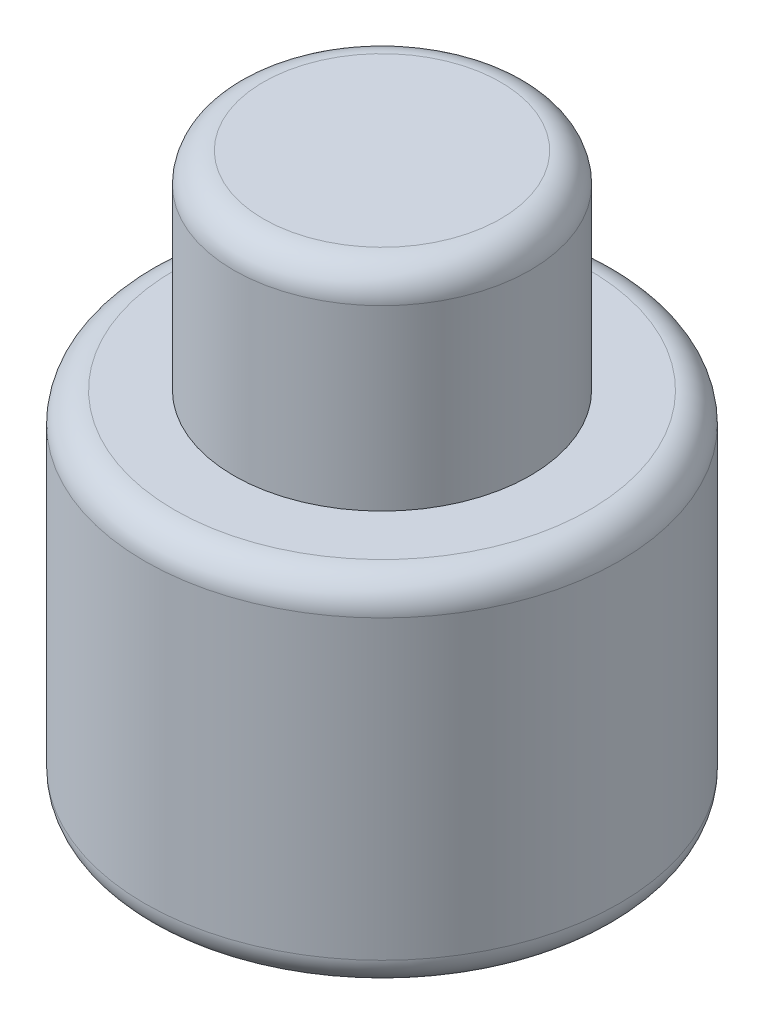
ISO-10303-21;
HEADER;
FILE_DESCRIPTION(('STEP AP214'),'2;1');
FILE_NAME('part.step','',(''),(''),'','','');
FILE_SCHEMA(('AUTOMOTIVE_DESIGN { 1 0 10303 214 1 1 1 1 }'));
ENDSEC;
DATA;
#1=APPLICATION_CONTEXT('core data for automotive mechanical design processes');
#2=APPLICATION_PROTOCOL_DEFINITION('international standard','automotive_design',2000,#1);
#3=PRODUCT_CONTEXT('',#1,'mechanical');
#4=PRODUCT('Part','Part','',(#3));
#5=PRODUCT_RELATED_PRODUCT_CATEGORY('part','',(#4));
#6=PRODUCT_DEFINITION_FORMATION('','',#4);
#7=PRODUCT_DEFINITION_CONTEXT('part definition',#1,'design');
#8=PRODUCT_DEFINITION('design','',#6,#7);
#9=PRODUCT_DEFINITION_SHAPE('','',#8);
#10=(LENGTH_UNIT() NAMED_UNIT(*) SI_UNIT(.MILLI.,.METRE.));
#11=(NAMED_UNIT(*) PLANE_ANGLE_UNIT() SI_UNIT($,.RADIAN.));
#12=(NAMED_UNIT(*) SI_UNIT($,.STERADIAN.) SOLID_ANGLE_UNIT());
#13=UNCERTAINTY_MEASURE_WITH_UNIT(LENGTH_MEASURE(1.E-05),#10,'distance_accuracy_value','');
#14=(GEOMETRIC_REPRESENTATION_CONTEXT(3) GLOBAL_UNCERTAINTY_ASSIGNED_CONTEXT((#13)) GLOBAL_UNIT_ASSIGNED_CONTEXT((#10,
#11,#12)) REPRESENTATION_CONTEXT('',''));
#15=CARTESIAN_POINT('',(0.,0.,0.));
#16=DIRECTION('',(0.,0.,1.));
#17=DIRECTION('',(1.,0.,0.));
#18=AXIS2_PLACEMENT_3D('',#15,#16,#17);
#19=CARTESIAN_POINT('',(4.,0.,0.));
#20=DIRECTION('',(0.,-1.,0.));
#21=DIRECTION('',(0.,0.,-1.));
#22=AXIS2_PLACEMENT_3D('',#19,#20,#21);
#23=PLANE('',#22);
#24=CARTESIAN_POINT('',(0.,0.,0.));
#25=DIRECTION('',(0.,-1.,0.));
#26=DIRECTION('',(0.,0.,-1.));
#27=AXIS2_PLACEMENT_3D('',#24,#25,#26);
#28=CIRCLE('',#27,3.5);
#29=CARTESIAN_POINT('',(0.,0.,-3.5));
#30=VERTEX_POINT('',#29);
#31=EDGE_CURVE('E46',#30,#30,#28,.T.);
#32=ORIENTED_EDGE('',*,*,#31,.T.);
#33=EDGE_LOOP('',(#32));
#34=FACE_BOUND('',#33,.T.);
#35=ADVANCED_FACE('F24',(#34),#23,.T.);
#36=CARTESIAN_POINT('',(0.,9.5,0.));
#37=DIRECTION('',(0.,1.,0.));
#38=DIRECTION('',(0.,0.,1.));
#39=AXIS2_PLACEMENT_3D('',#36,#37,#38);
#40=PLANE('',#39);
#41=CARTESIAN_POINT('',(0.,9.5,0.));
#42=DIRECTION('',(0.,1.,0.));
#43=DIRECTION('',(0.,0.,1.));
#44=AXIS2_PLACEMENT_3D('',#41,#42,#43);
#45=CIRCLE('',#44,2.);
#46=CARTESIAN_POINT('',(0.,9.5,2.));
#47=VERTEX_POINT('',#46);
#48=EDGE_CURVE('E10',#47,#47,#45,.T.);
#49=ORIENTED_EDGE('',*,*,#48,.T.);
#50=EDGE_LOOP('',(#49));
#51=FACE_BOUND('',#50,.T.);
#52=ADVANCED_FACE('F57',(#51),#40,.T.);
#53=CARTESIAN_POINT('',(0.,0.,0.));
#54=DIRECTION('',(0.,-1.,0.));
#55=DIRECTION('',(0.,0.,-1.));
#56=AXIS2_PLACEMENT_3D('',#53,#54,#55);
#57=CYLINDRICAL_SURFACE('',#56,2.5);
#58=CARTESIAN_POINT('',(0.,9.,0.));
#59=DIRECTION('',(0.,1.,0.));
#60=DIRECTION('',(0.,0.,1.));
#61=AXIS2_PLACEMENT_3D('',#58,#59,#60);
#62=CIRCLE('',#61,2.5);
#63=CARTESIAN_POINT('',(0.,9.,2.5));
#64=VERTEX_POINT('',#63);
#65=EDGE_CURVE('E30',#64,#64,#62,.F.);
#66=ORIENTED_EDGE('',*,*,#65,.T.);
#67=EDGE_LOOP('',(#66));
#68=FACE_BOUND('',#67,.T.);
#69=CARTESIAN_POINT('',(0.,6.,0.));
#70=DIRECTION('',(0.,-1.,0.));
#71=DIRECTION('',(0.,0.,-1.));
#72=AXIS2_PLACEMENT_3D('',#69,#70,#71);
#73=CIRCLE('',#72,2.5);
#74=CARTESIAN_POINT('',(0.,6.,-2.5));
#75=VERTEX_POINT('',#74);
#76=EDGE_CURVE('E49',#75,#75,#73,.T.);
#77=ORIENTED_EDGE('',*,*,#76,.F.);
#78=EDGE_LOOP('',(#77));
#79=FACE_BOUND('',#78,.T.);
#80=ADVANCED_FACE('F55',(#68,#79),#57,.T.);
#81=CARTESIAN_POINT('',(2.5,6.,0.));
#82=DIRECTION('',(0.,1.,0.));
#83=DIRECTION('',(0.,0.,1.));
#84=AXIS2_PLACEMENT_3D('',#81,#82,#83);
#85=PLANE('',#84);
#86=CARTESIAN_POINT('',(0.,6.,0.));
#87=DIRECTION('',(0.,1.,0.));
#88=DIRECTION('',(0.,0.,1.));
#89=AXIS2_PLACEMENT_3D('',#86,#87,#88);
#90=CIRCLE('',#89,3.5);
#91=CARTESIAN_POINT('',(0.,6.,3.5));
#92=VERTEX_POINT('',#91);
#93=EDGE_CURVE('E34',#92,#92,#90,.T.);
#94=ORIENTED_EDGE('',*,*,#93,.T.);
#95=EDGE_LOOP('',(#94));
#96=FACE_BOUND('',#95,.T.);
#97=ORIENTED_EDGE('',*,*,#76,.T.);
#98=EDGE_LOOP('',(#97));
#99=FACE_BOUND('',#98,.T.);
#100=ADVANCED_FACE('F53',(#96,#99),#85,.T.);
#101=CARTESIAN_POINT('',(0.,0.,0.));
#102=DIRECTION('',(0.,-1.,0.));
#103=DIRECTION('',(0.,0.,-1.));
#104=AXIS2_PLACEMENT_3D('',#101,#102,#103);
#105=CYLINDRICAL_SURFACE('',#104,4.);
#106=CARTESIAN_POINT('',(0.,0.5,0.));
#107=DIRECTION('',(0.,-1.,0.));
#108=DIRECTION('',(0.,0.,-1.));
#109=AXIS2_PLACEMENT_3D('',#106,#107,#108);
#110=CIRCLE('',#109,4.);
#111=CARTESIAN_POINT('',(0.,0.5,-4.));
#112=VERTEX_POINT('',#111);
#113=EDGE_CURVE('E38',#112,#112,#110,.F.);
#114=ORIENTED_EDGE('',*,*,#113,.T.);
#115=EDGE_LOOP('',(#114));
#116=FACE_BOUND('',#115,.T.);
#117=CARTESIAN_POINT('',(0.,5.5,0.));
#118=DIRECTION('',(0.,1.,0.));
#119=DIRECTION('',(0.,0.,1.));
#120=AXIS2_PLACEMENT_3D('',#117,#118,#119);
#121=CIRCLE('',#120,4.);
#122=CARTESIAN_POINT('',(0.,5.5,4.));
#123=VERTEX_POINT('',#122);
#124=EDGE_CURVE('E43',#123,#123,#121,.F.);
#125=ORIENTED_EDGE('',*,*,#124,.T.);
#126=EDGE_LOOP('',(#125));
#127=FACE_BOUND('',#126,.T.);
#128=ADVANCED_FACE('F63',(#116,#127),#105,.T.);
#129=CARTESIAN_POINT('',(0.,0.5,0.));
#130=DIRECTION('',(0.,-1.,0.));
#131=DIRECTION('',(0.,0.,-1.));
#132=AXIS2_PLACEMENT_3D('',#129,#130,#131);
#133=TOROIDAL_SURFACE('',#132,3.5,0.5);
#134=ORIENTED_EDGE('',*,*,#113,.F.);
#135=EDGE_LOOP('',(#134));
#136=FACE_BOUND('',#135,.T.);
#137=ORIENTED_EDGE('',*,*,#31,.F.);
#138=EDGE_LOOP('',(#137));
#139=FACE_BOUND('',#138,.T.);
#140=ADVANCED_FACE('F72',(#136,#139),#133,.T.);
#141=CARTESIAN_POINT('',(0.,5.5,0.));
#142=DIRECTION('',(0.,1.,0.));
#143=DIRECTION('',(0.,0.,1.));
#144=AXIS2_PLACEMENT_3D('',#141,#142,#143);
#145=TOROIDAL_SURFACE('',#144,3.5,0.5);
#146=ORIENTED_EDGE('',*,*,#93,.F.);
#147=EDGE_LOOP('',(#146));
#148=FACE_BOUND('',#147,.T.);
#149=ORIENTED_EDGE('',*,*,#124,.F.);
#150=EDGE_LOOP('',(#149));
#151=FACE_BOUND('',#150,.T.);
#152=ADVANCED_FACE('F74',(#148,#151),#145,.T.);
#153=CARTESIAN_POINT('',(0.,9.,0.));
#154=DIRECTION('',(0.,1.,0.));
#155=DIRECTION('',(0.,0.,1.));
#156=AXIS2_PLACEMENT_3D('',#153,#154,#155);
#157=TOROIDAL_SURFACE('',#156,2.,0.5);
#158=ORIENTED_EDGE('',*,*,#48,.F.);
#159=EDGE_LOOP('',(#158));
#160=FACE_BOUND('',#159,.T.);
#161=ORIENTED_EDGE('',*,*,#65,.F.);
#162=EDGE_LOOP('',(#161));
#163=FACE_BOUND('',#162,.T.);
#164=ADVANCED_FACE('F81',(#160,#163),#157,.T.);
#165=CLOSED_SHELL('',(#35,#52,#80,#100,#128,#140,#152,#164));
#166=MANIFOLD_SOLID_BREP('B2',#165);
#167=ADVANCED_BREP_SHAPE_REPRESENTATION('',(#18,#166),#14);
#168=SHAPE_DEFINITION_REPRESENTATION(#9,#167);
ENDSEC;
END-ISO-10303-21;
